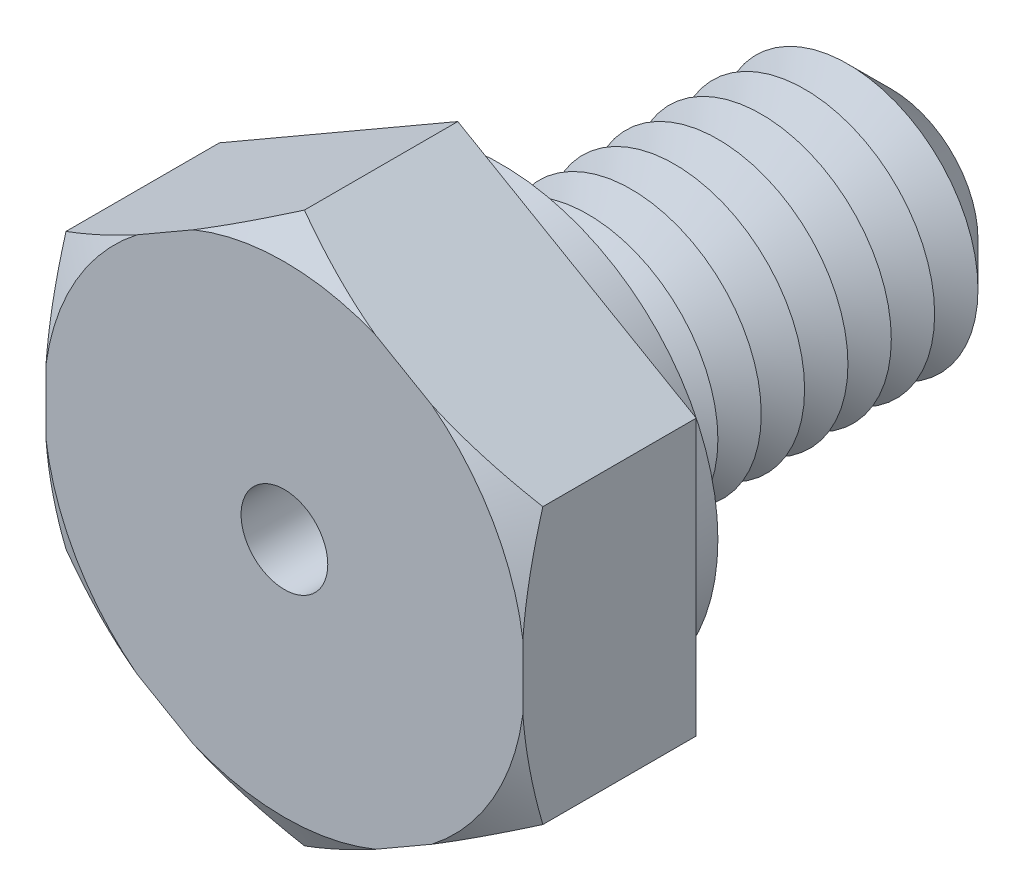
ISO-10303-21;
HEADER;
FILE_DESCRIPTION(('STEP AP214'),'2;1');
FILE_NAME('part.step','',(''),(''),'','','');
FILE_SCHEMA(('AUTOMOTIVE_DESIGN { 1 0 10303 214 1 1 1 1 }'));
ENDSEC;
DATA;
#1=APPLICATION_CONTEXT('core data for automotive mechanical design processes');
#2=APPLICATION_PROTOCOL_DEFINITION('international standard','automotive_design',2000,#1);
#3=PRODUCT_CONTEXT('',#1,'mechanical');
#4=PRODUCT('Part','Part','',(#3));
#5=PRODUCT_RELATED_PRODUCT_CATEGORY('part','',(#4));
#6=PRODUCT_DEFINITION_FORMATION('','',#4);
#7=PRODUCT_DEFINITION_CONTEXT('part definition',#1,'design');
#8=PRODUCT_DEFINITION('design','',#6,#7);
#9=PRODUCT_DEFINITION_SHAPE('','',#8);
#10=(LENGTH_UNIT() NAMED_UNIT(*) SI_UNIT(.MILLI.,.METRE.));
#11=(NAMED_UNIT(*) PLANE_ANGLE_UNIT() SI_UNIT($,.RADIAN.));
#12=(NAMED_UNIT(*) SI_UNIT($,.STERADIAN.) SOLID_ANGLE_UNIT());
#13=UNCERTAINTY_MEASURE_WITH_UNIT(LENGTH_MEASURE(1.E-05),#10,'distance_accuracy_value','');
#14=(GEOMETRIC_REPRESENTATION_CONTEXT(3) GLOBAL_UNCERTAINTY_ASSIGNED_CONTEXT((#13)) GLOBAL_UNIT_ASSIGNED_CONTEXT((#10,
#11,#12)) REPRESENTATION_CONTEXT('',''));
#15=CARTESIAN_POINT('',(0.,0.,0.));
#16=DIRECTION('',(0.,0.,1.));
#17=DIRECTION('',(1.,0.,0.));
#18=AXIS2_PLACEMENT_3D('',#15,#16,#17);
#19=CARTESIAN_POINT('',(2.75,1.58771324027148,2.));
#20=DIRECTION('',(-0.5,-0.866025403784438,0.));
#21=DIRECTION('',(0.866025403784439,-0.5,0.));
#22=AXIS2_PLACEMENT_3D('',#19,#20,#21);
#23=PLANE('',#22);
#24=CARTESIAN_POINT('',(4.66048793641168,0.484692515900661,0.897146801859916));
#25=CARTESIAN_POINT('',(4.57407924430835,0.534580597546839,0.943778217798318));
#26=CARTESIAN_POINT('',(4.48746398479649,0.584587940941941,0.989906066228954));
#27=CARTESIAN_POINT('',(4.31373297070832,0.684891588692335,1.08092005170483));
#28=CARTESIAN_POINT('',(4.22661715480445,0.735187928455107,1.12580603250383));
#29=CARTESIAN_POINT('',(4.05153903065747,0.836269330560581,1.21423144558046));
#30=CARTESIAN_POINT('',(3.96357490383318,0.887055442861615,1.25776609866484));
#31=CARTESIAN_POINT('',(3.78698874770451,0.989007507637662,1.34300583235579));
#32=CARTESIAN_POINT('',(3.69836673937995,1.04017344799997,1.38471097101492));
#33=CARTESIAN_POINT('',(3.42682968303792,1.196945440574,1.50858888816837));
#34=CARTESIAN_POINT('',(3.2426849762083,1.30326143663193,1.58723569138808));
#35=CARTESIAN_POINT('',(2.87039319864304,1.51820419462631,1.73037556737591));
#36=CARTESIAN_POINT('',(2.68225085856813,1.62682822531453,1.7948844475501));
#37=CARTESIAN_POINT('',(2.36072167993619,1.81246318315,1.88587189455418));
#38=CARTESIAN_POINT('',(2.22854222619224,1.88877702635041,1.91793719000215));
#39=CARTESIAN_POINT('',(1.9623222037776,2.04247922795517,1.96931401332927));
#40=CARTESIAN_POINT('',(1.82828230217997,2.11986720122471,1.98862999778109));
#41=CARTESIAN_POINT('',(1.56075616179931,2.27432349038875,2.0122791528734));
#42=CARTESIAN_POINT('',(1.42728171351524,2.35138499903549,2.01678452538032));
#43=CARTESIAN_POINT('',(1.16057863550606,2.50536609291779,2.01073620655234));
#44=CARTESIAN_POINT('',(1.02735002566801,2.58228566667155,2.00018134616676));
#45=CARTESIAN_POINT('',(0.804211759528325,2.71111460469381,1.97079823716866));
#46=CARTESIAN_POINT('',(0.7139172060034,2.76324618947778,1.95563842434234));
#47=CARTESIAN_POINT('',(0.534175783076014,2.86701994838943,1.91960186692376));
#48=CARTESIAN_POINT('',(0.444729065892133,2.91866203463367,1.89872411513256));
#49=CARTESIAN_POINT('',(0.266714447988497,3.02143882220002,1.85203328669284));
#50=CARTESIAN_POINT('',(0.178147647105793,3.07257288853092,1.82621469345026));
#51=CARTESIAN_POINT('',(0.002007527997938,3.17426743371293,1.77045729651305));
#52=CARTESIAN_POINT('',(-0.0855658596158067,3.22482795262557,1.74051878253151));
#53=CARTESIAN_POINT('',(-0.260818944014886,3.32601036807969,1.67685588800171));
#54=CARTESIAN_POINT('',(-0.348487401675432,3.37662577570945,1.64309053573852));
#55=CARTESIAN_POINT('',(-0.522893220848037,3.47731902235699,1.57271678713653));
#56=CARTESIAN_POINT('',(-0.609631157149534,3.52739719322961,1.53611027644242));
#57=CARTESIAN_POINT('',(-0.868655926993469,3.67694521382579,1.4228111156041));
#58=CARTESIAN_POINT('',(-1.03979736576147,3.775753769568,1.34262239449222));
#59=CARTESIAN_POINT('',(-1.26895816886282,3.90805982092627,1.23025748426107));
#60=CARTESIAN_POINT('',(-1.32802105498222,3.94215979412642,1.20084468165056));
#61=CARTESIAN_POINT('',(-1.44588766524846,4.01021011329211,1.14133764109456));
#62=CARTESIAN_POINT('',(-1.50469139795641,4.0441604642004,1.11124342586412));
#63=CARTESIAN_POINT('',(-1.67950896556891,4.14509143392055,1.02069737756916));
#64=CARTESIAN_POINT('',(-1.79518197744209,4.2118752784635,0.959363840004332));
#65=CARTESIAN_POINT('',(-1.91048793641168,4.27844720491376,0.897146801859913));
#66=B_SPLINE_CURVE_WITH_KNOTS('',3,(#24,#25,#26,#27,#28,#29,#30,#31,#32,#33,#34,#35,#36,#37,#38,
#39,#40,#41,#42,#43,#44,#45,#46,#47,#48,#49,#50,#51,#52,#53,#54,#55,#56,#57,#58,#59,#60,#61,#62,
#63,#64,#65),.UNSPECIFIED.,.F.,.F.,(4,2,2,2,2,2,2,2,2,2,2,2,2,2,2,2,2,2,2,2,4),(0.,
0.330408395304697,0.660858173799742,0.992367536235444,1.32386637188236,2.00369971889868,
2.68276903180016,3.15022294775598,3.61751337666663,4.0793510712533,4.54122461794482,
4.85714368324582,5.17311843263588,5.4894480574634,5.80575544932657,6.12584332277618,
6.44572054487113,7.08531613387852,7.30813289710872,7.5309422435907,7.97184194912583),.UNSPECIFIED.);
#67=CARTESIAN_POINT('',(2.75,1.58771324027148,1.76905989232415));
#68=VERTEX_POINT('',#67);
#69=CARTESIAN_POINT('',(1.69960608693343,2.1941584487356,2.));
#70=VERTEX_POINT('',#69);
#71=EDGE_CURVE('E132',#68,#70,#66,.T.);
#72=ORIENTED_EDGE('',*,*,#71,.F.);
#73=DIRECTION('',(0.,0.,-1.));
#74=VECTOR('',#73,1.);
#75=CARTESIAN_POINT('',(2.75,1.58771324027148,2.));
#76=LINE('',#75,#74);
#77=CARTESIAN_POINT('',(2.75,1.58771324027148,0.));
#78=VERTEX_POINT('',#77);
#79=EDGE_CURVE('E144',#68,#78,#76,.T.);
#80=ORIENTED_EDGE('',*,*,#79,.T.);
#81=DIRECTION('',(-0.866025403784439,0.5,0.));
#82=VECTOR('',#81,1.);
#83=CARTESIAN_POINT('',(2.75,1.58771324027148,0.));
#84=LINE('',#83,#82);
#85=CARTESIAN_POINT('',(0.,3.17542648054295,0.));
#86=VERTEX_POINT('',#85);
#87=EDGE_CURVE('E237',#78,#86,#84,.T.);
#88=ORIENTED_EDGE('',*,*,#87,.T.);
#89=DIRECTION('',(0.,0.,-1.));
#90=VECTOR('',#89,1.);
#91=CARTESIAN_POINT('',(0.,3.17542648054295,2.));
#92=LINE('',#91,#90);
#93=CARTESIAN_POINT('',(0.,3.17542648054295,1.76905989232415));
#94=VERTEX_POINT('',#93);
#95=EDGE_CURVE('E179',#94,#86,#92,.T.);
#96=ORIENTED_EDGE('',*,*,#95,.F.);
#97=CARTESIAN_POINT('',(1.05039391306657,2.56898127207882,2.));
#98=VERTEX_POINT('',#97);
#99=EDGE_CURVE('E151',#98,#94,#66,.T.);
#100=ORIENTED_EDGE('',*,*,#99,.F.);
#101=DIRECTION('',(-0.866025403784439,0.5,0.));
#102=VECTOR('',#101,1.);
#103=CARTESIAN_POINT('',(2.75,1.58771324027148,2.));
#104=LINE('',#103,#102);
#105=EDGE_CURVE('E148',#70,#98,#104,.T.);
#106=ORIENTED_EDGE('',*,*,#105,.F.);
#107=EDGE_LOOP('',(#72,#80,#88,#96,#100,#106));
#108=FACE_BOUND('',#107,.T.);
#109=ADVANCED_FACE('F39',(#108),#23,.F.);
#110=CARTESIAN_POINT('',(0.,3.17542648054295,2.));
#111=DIRECTION('',(0.5,-0.866025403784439,0.));
#112=DIRECTION('',(0.866025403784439,0.5,0.));
#113=AXIS2_PLACEMENT_3D('',#110,#111,#112);
#114=PLANE('',#113);
#115=CARTESIAN_POINT('',(1.91048793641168,4.27844720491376,0.897146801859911));
#116=CARTESIAN_POINT('',(1.82407924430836,4.22855912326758,0.943778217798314));
#117=CARTESIAN_POINT('',(1.7374639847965,4.17855177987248,0.98990606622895));
#118=CARTESIAN_POINT('',(1.56373297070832,4.07824813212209,1.08092005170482));
#119=CARTESIAN_POINT('',(1.47661715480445,4.02795179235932,1.12580603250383));
#120=CARTESIAN_POINT('',(1.30153903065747,3.92687039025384,1.21423144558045));
#121=CARTESIAN_POINT('',(1.21357490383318,3.87608427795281,1.25776609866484));
#122=CARTESIAN_POINT('',(1.03698874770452,3.77413221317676,1.34300583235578));
#123=CARTESIAN_POINT('',(0.948366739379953,3.72296627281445,1.38471097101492));
#124=CARTESIAN_POINT('',(0.676829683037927,3.56619428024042,1.50858888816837));
#125=CARTESIAN_POINT('',(0.492684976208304,3.45987828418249,1.58723569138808));
#126=CARTESIAN_POINT('',(0.120393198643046,3.24493552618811,1.73037556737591));
#127=CARTESIAN_POINT('',(-0.0677491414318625,3.13631149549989,1.7948844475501));
#128=CARTESIAN_POINT('',(-0.389278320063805,2.95067653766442,1.88587189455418));
#129=CARTESIAN_POINT('',(-0.521457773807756,2.87436269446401,1.91793719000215));
#130=CARTESIAN_POINT('',(-0.787677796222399,2.72066049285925,1.96931401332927));
#131=CARTESIAN_POINT('',(-0.921717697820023,2.64327251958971,1.98862999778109));
#132=CARTESIAN_POINT('',(-1.18924383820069,2.48881623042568,2.0122791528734));
#133=CARTESIAN_POINT('',(-1.32271828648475,2.41175472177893,2.01678452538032));
#134=CARTESIAN_POINT('',(-1.58942136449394,2.25777362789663,2.01073620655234));
#135=CARTESIAN_POINT('',(-1.72264997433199,2.18085405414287,2.00018134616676));
#136=CARTESIAN_POINT('',(-1.94578824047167,2.05202511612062,1.97079823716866));
#137=CARTESIAN_POINT('',(-2.0360827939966,1.99989353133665,1.95563842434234));
#138=CARTESIAN_POINT('',(-2.21582421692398,1.89611977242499,1.91960186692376));
#139=CARTESIAN_POINT('',(-2.30527093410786,1.84447768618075,1.89872411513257));
#140=CARTESIAN_POINT('',(-2.4832855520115,1.7417008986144,1.85203328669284));
#141=CARTESIAN_POINT('',(-2.5718523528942,1.69056683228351,1.82621469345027));
#142=CARTESIAN_POINT('',(-2.74799247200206,1.5888722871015,1.77045729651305));
#143=CARTESIAN_POINT('',(-2.8355658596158,1.53831176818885,1.74051878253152));
#144=CARTESIAN_POINT('',(-3.01081894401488,1.43712935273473,1.67685588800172));
#145=CARTESIAN_POINT('',(-3.09848740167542,1.38651394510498,1.64309053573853));
#146=CARTESIAN_POINT('',(-3.27289322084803,1.28582069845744,1.57271678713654));
#147=CARTESIAN_POINT('',(-3.35963115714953,1.23574252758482,1.53611027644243));
#148=CARTESIAN_POINT('',(-3.61865592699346,1.08619450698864,1.42281111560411));
#149=CARTESIAN_POINT('',(-3.78979736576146,0.987385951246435,1.34262239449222));
#150=CARTESIAN_POINT('',(-4.01895816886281,0.855079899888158,1.23025748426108));
#151=CARTESIAN_POINT('',(-4.07802105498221,0.820979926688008,1.20084468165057));
#152=CARTESIAN_POINT('',(-4.19588766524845,0.752929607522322,1.14133764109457));
#153=CARTESIAN_POINT('',(-4.25469139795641,0.71897925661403,1.11124342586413));
#154=CARTESIAN_POINT('',(-4.42950896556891,0.618048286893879,1.02069737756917));
#155=CARTESIAN_POINT('',(-4.54518197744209,0.551264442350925,0.959363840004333));
#156=CARTESIAN_POINT('',(-4.66048793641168,0.48469251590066,0.897146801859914));
#157=B_SPLINE_CURVE_WITH_KNOTS('',3,(#115,#116,#117,#118,#119,#120,#121,#122,#123,#124,#125,
#126,#127,#128,#129,#130,#131,#132,#133,#134,#135,#136,#137,#138,#139,#140,#141,#142,#143,#144,
#145,#146,#147,#148,#149,#150,#151,#152,#153,#154,#155,#156),.UNSPECIFIED.,.F.,.F.,(4,2,2,2,2,2,
2,2,2,2,2,2,2,2,2,2,2,2,2,2,4),(0.,0.330408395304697,0.660858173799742,0.992367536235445,
1.32386637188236,2.00369971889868,2.68276903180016,3.15022294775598,3.61751337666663,
4.0793510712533,4.54122461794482,4.85714368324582,5.17311843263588,5.48944805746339,
5.80575544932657,6.12584332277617,6.44572054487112,7.08531613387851,7.30813289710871,
7.53094224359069,7.97184194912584),.UNSPECIFIED.);
#158=CARTESIAN_POINT('',(-1.05039391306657,2.56898127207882,2.));
#159=VERTEX_POINT('',#158);
#160=EDGE_CURVE('E334',#94,#159,#157,.T.);
#161=ORIENTED_EDGE('',*,*,#160,.F.);
#162=ORIENTED_EDGE('',*,*,#95,.T.);
#163=DIRECTION('',(-0.866025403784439,-0.5,0.));
#164=VECTOR('',#163,1.);
#165=CARTESIAN_POINT('',(0.,3.17542648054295,0.));
#166=LINE('',#165,#164);
#167=CARTESIAN_POINT('',(-2.75,1.58771324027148,0.));
#168=VERTEX_POINT('',#167);
#169=EDGE_CURVE('E240',#86,#168,#166,.T.);
#170=ORIENTED_EDGE('',*,*,#169,.T.);
#171=DIRECTION('',(0.,0.,-1.));
#172=VECTOR('',#171,1.);
#173=CARTESIAN_POINT('',(-2.75,1.58771324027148,2.));
#174=LINE('',#173,#172);
#175=CARTESIAN_POINT('',(-2.75,1.58771324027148,1.76905989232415));
#176=VERTEX_POINT('',#175);
#177=EDGE_CURVE('E176',#176,#168,#174,.T.);
#178=ORIENTED_EDGE('',*,*,#177,.F.);
#179=CARTESIAN_POINT('',(-1.69960608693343,2.1941584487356,2.));
#180=VERTEX_POINT('',#179);
#181=EDGE_CURVE('E327',#180,#176,#157,.T.);
#182=ORIENTED_EDGE('',*,*,#181,.F.);
#183=DIRECTION('',(-0.866025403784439,-0.5,0.));
#184=VECTOR('',#183,1.);
#185=CARTESIAN_POINT('',(0.,3.17542648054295,2.));
#186=LINE('',#185,#184);
#187=EDGE_CURVE('E215',#159,#180,#186,.T.);
#188=ORIENTED_EDGE('',*,*,#187,.F.);
#189=EDGE_LOOP('',(#161,#162,#170,#178,#182,#188));
#190=FACE_BOUND('',#189,.T.);
#191=ADVANCED_FACE('F340',(#190),#114,.F.);
#192=CARTESIAN_POINT('',(-2.75,1.58771324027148,2.));
#193=DIRECTION('',(1.,0.,0.));
#194=DIRECTION('',(0.,0.,-1.));
#195=AXIS2_PLACEMENT_3D('',#192,#193,#194);
#196=PLANE('',#195);
#197=CARTESIAN_POINT('',(-2.75,3.49820117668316,1.03335245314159));
#198=CARTESIAN_POINT('',(-2.75,3.3988452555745,1.07843728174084));
#199=CARTESIAN_POINT('',(-2.75,3.29921780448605,1.12293477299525));
#200=CARTESIAN_POINT('',(-2.75,3.09930320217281,1.21047025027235));
#201=CARTESIAN_POINT('',(-2.75,2.9990159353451,1.25350797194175));
#202=CARTESIAN_POINT('',(-2.75,2.79728071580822,1.33799855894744));
#203=CARTESIAN_POINT('',(-2.75,2.69582966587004,1.37944406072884));
#204=CARTESIAN_POINT('',(-2.75,2.49207131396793,1.46016516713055));
#205=CARTESIAN_POINT('',(-2.75,2.38976405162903,1.49944087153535));
#206=CARTESIAN_POINT('',(-2.75,2.18462050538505,1.57517230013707));
#207=CARTESIAN_POINT('',(-2.75,2.0817886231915,1.61163983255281));
#208=CARTESIAN_POINT('',(-2.75,1.87503931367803,1.68134876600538));
#209=CARTESIAN_POINT('',(-2.75,1.7711218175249,1.71458996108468));
#210=CARTESIAN_POINT('',(-2.75,1.45784948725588,1.80833694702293));
#211=CARTESIAN_POINT('',(-2.75,1.24663799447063,1.86299520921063));
#212=CARTESIAN_POINT('',(-2.75,0.880007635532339,1.93741428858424));
#213=CARTESIAN_POINT('',(-2.75,0.725721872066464,1.96267397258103));
#214=CARTESIAN_POINT('',(-2.75,0.415477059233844,1.99905142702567));
#215=CARTESIAN_POINT('',(-2.75,0.259518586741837,2.01017392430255));
#216=CARTESIAN_POINT('',(-2.75,-0.052664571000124,2.01694102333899));
#217=CARTESIAN_POINT('',(-2.75,-0.208889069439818,2.01259389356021));
#218=CARTESIAN_POINT('',(-2.75,-0.52017905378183,1.98898893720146));
#219=CARTESIAN_POINT('',(-2.75,-0.675244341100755,1.96972861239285));
#220=CARTESIAN_POINT('',(-2.75,-1.06031237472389,1.90556109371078));
#221=CARTESIAN_POINT('',(-2.75,-1.28896433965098,1.85264132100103));
#222=CARTESIAN_POINT('',(-2.75,-1.62776674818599,1.75827794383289));
#223=CARTESIAN_POINT('',(-2.75,-1.7401527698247,1.72427052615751));
#224=CARTESIAN_POINT('',(-2.75,-1.96362143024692,1.65220283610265));
#225=CARTESIAN_POINT('',(-2.75,-2.07470418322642,1.61414292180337));
#226=CARTESIAN_POINT('',(-2.75,-2.29695720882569,1.53431422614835));
#227=CARTESIAN_POINT('',(-2.75,-2.40811380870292,1.49250783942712));
#228=CARTESIAN_POINT('',(-2.75,-2.6293886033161,1.40621968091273));
#229=CARTESIAN_POINT('',(-2.75,-2.73950673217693,1.36173774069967));
#230=CARTESIAN_POINT('',(-2.75,-2.95816234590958,1.27090723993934));
#231=CARTESIAN_POINT('',(-2.75,-3.06670540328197,1.22457202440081));
#232=CARTESIAN_POINT('',(-2.75,-3.2830047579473,1.130169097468));
#233=CARTESIAN_POINT('',(-2.75,-3.39076124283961,1.08210181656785));
#234=CARTESIAN_POINT('',(-2.75,-3.49820117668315,1.03335245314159));
#235=B_SPLINE_CURVE_WITH_KNOTS('',3,(#197,#198,#199,#200,#201,#202,#203,#204,#205,#206,#207,
#208,#209,#210,#211,#212,#213,#214,#215,#216,#217,#218,#219,#220,#221,#222,#223,#224,#225,#226,
#227,#228,#229,#230,#231,#232,#233,#234),.UNSPECIFIED.,.F.,.F.,(4,2,2,2,2,2,2,2,2,2,2,2,2,2,2,2,
2,2,4),(0.,0.327324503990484,0.654707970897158,0.983457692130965,1.31219228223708,
1.63945907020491,1.96674673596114,2.62024190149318,3.08872929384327,3.55706000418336,
4.02514043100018,4.49329928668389,5.19584793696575,5.54806763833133,5.9002562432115,
6.25649337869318,6.61275296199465,6.96679459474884,7.320748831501),.UNSPECIFIED.);
#236=CARTESIAN_POINT('',(-2.75,0.374822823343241,2.));
#237=VERTEX_POINT('',#236);
#238=EDGE_CURVE('E222',#176,#237,#235,.T.);
#239=ORIENTED_EDGE('',*,*,#238,.F.);
#240=ORIENTED_EDGE('',*,*,#177,.T.);
#241=DIRECTION('',(0.,-1.,0.));
#242=VECTOR('',#241,1.);
#243=CARTESIAN_POINT('',(-2.75,1.58771324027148,0.));
#244=LINE('',#243,#242);
#245=CARTESIAN_POINT('',(-2.75,-1.58771324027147,0.));
#246=VERTEX_POINT('',#245);
#247=EDGE_CURVE('E244',#168,#246,#244,.T.);
#248=ORIENTED_EDGE('',*,*,#247,.T.);
#249=DIRECTION('',(0.,0.,-1.));
#250=VECTOR('',#249,1.);
#251=CARTESIAN_POINT('',(-2.75,-1.58771324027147,2.));
#252=LINE('',#251,#250);
#253=CARTESIAN_POINT('',(-2.75000000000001,-1.58771324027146,1.76905989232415));
#254=VERTEX_POINT('',#253);
#255=EDGE_CURVE('E173',#254,#246,#252,.T.);
#256=ORIENTED_EDGE('',*,*,#255,.F.);
#257=CARTESIAN_POINT('',(-2.75,-0.374822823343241,2.));
#258=VERTEX_POINT('',#257);
#259=EDGE_CURVE('E225',#258,#254,#235,.T.);
#260=ORIENTED_EDGE('',*,*,#259,.F.);
#261=DIRECTION('',(0.,-1.,0.));
#262=VECTOR('',#261,1.);
#263=CARTESIAN_POINT('',(-2.75,1.58771324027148,2.));
#264=LINE('',#263,#262);
#265=EDGE_CURVE('E213',#237,#258,#264,.T.);
#266=ORIENTED_EDGE('',*,*,#265,.F.);
#267=EDGE_LOOP('',(#239,#240,#248,#256,#260,#266));
#268=FACE_BOUND('',#267,.T.);
#269=ADVANCED_FACE('F221',(#268),#196,.F.);
#270=CARTESIAN_POINT('',(-2.75,-1.58771324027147,2.));
#271=DIRECTION('',(0.5,0.866025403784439,0.));
#272=DIRECTION('',(-0.866025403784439,0.5,0.));
#273=AXIS2_PLACEMENT_3D('',#270,#271,#272);
#274=PLANE('',#273);
#275=CARTESIAN_POINT('',(-4.66048793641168,-0.48469251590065,0.897146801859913));
#276=CARTESIAN_POINT('',(-4.57407924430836,-0.534580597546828,0.943778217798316));
#277=CARTESIAN_POINT('',(-4.4874639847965,-0.58458794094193,0.989906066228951));
#278=CARTESIAN_POINT('',(-4.31373297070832,-0.684891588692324,1.08092005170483));
#279=CARTESIAN_POINT('',(-4.22661715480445,-0.735187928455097,1.12580603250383));
#280=CARTESIAN_POINT('',(-4.05153903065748,-0.83626933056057,1.21423144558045));
#281=CARTESIAN_POINT('',(-3.96357490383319,-0.887055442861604,1.25776609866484));
#282=CARTESIAN_POINT('',(-3.78698874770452,-0.989007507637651,1.34300583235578));
#283=CARTESIAN_POINT('',(-3.69836673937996,-1.04017344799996,1.38471097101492));
#284=CARTESIAN_POINT('',(-3.42682968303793,-1.19694544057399,1.50858888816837));
#285=CARTESIAN_POINT('',(-3.24268497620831,-1.30326143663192,1.58723569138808));
#286=CARTESIAN_POINT('',(-2.87039319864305,-1.5182041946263,1.73037556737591));
#287=CARTESIAN_POINT('',(-2.68225085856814,-1.62682822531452,1.7948844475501));
#288=CARTESIAN_POINT('',(-2.3607216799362,-1.81246318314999,1.88587189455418));
#289=CARTESIAN_POINT('',(-2.22854222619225,-1.8887770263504,1.91793719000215));
#290=CARTESIAN_POINT('',(-1.96232220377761,-2.04247922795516,1.96931401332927));
#291=CARTESIAN_POINT('',(-1.82828230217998,-2.1198672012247,1.98862999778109));
#292=CARTESIAN_POINT('',(-1.56075616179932,-2.27432349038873,2.0122791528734));
#293=CARTESIAN_POINT('',(-1.42728171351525,-2.35138499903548,2.01678452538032));
#294=CARTESIAN_POINT('',(-1.16057863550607,-2.50536609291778,2.01073620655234));
#295=CARTESIAN_POINT('',(-1.02735002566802,-2.58228566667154,2.00018134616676));
#296=CARTESIAN_POINT('',(-0.804211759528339,-2.71111460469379,1.97079823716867));
#297=CARTESIAN_POINT('',(-0.713917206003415,-2.76324618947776,1.95563842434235));
#298=CARTESIAN_POINT('',(-0.534175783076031,-2.86701994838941,1.91960186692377));
#299=CARTESIAN_POINT('',(-0.444729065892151,-2.91866203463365,1.89872411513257));
#300=CARTESIAN_POINT('',(-0.266714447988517,-3.02143882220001,1.85203328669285));
#301=CARTESIAN_POINT('',(-0.178147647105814,-3.0725728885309,1.82621469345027));
#302=CARTESIAN_POINT('',(-0.00200752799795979,-3.17426743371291,1.77045729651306));
#303=CARTESIAN_POINT('',(0.085565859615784,-3.22482795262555,1.74051878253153));
#304=CARTESIAN_POINT('',(0.260818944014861,-3.32601036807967,1.67685588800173));
#305=CARTESIAN_POINT('',(0.348487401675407,-3.37662577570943,1.64309053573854));
#306=CARTESIAN_POINT('',(0.522893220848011,-3.47731902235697,1.57271678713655));
#307=CARTESIAN_POINT('',(0.609631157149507,-3.52739719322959,1.53611027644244));
#308=CARTESIAN_POINT('',(0.86865592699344,-3.67694521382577,1.42281111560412));
#309=CARTESIAN_POINT('',(1.03979736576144,-3.77575376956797,1.34262239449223));
#310=CARTESIAN_POINT('',(1.26895816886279,-3.90805982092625,1.23025748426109));
#311=CARTESIAN_POINT('',(1.32802105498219,-3.9421597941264,1.20084468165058));
#312=CARTESIAN_POINT('',(1.44588766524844,-4.01021011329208,1.14133764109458));
#313=CARTESIAN_POINT('',(1.5046913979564,-4.04416046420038,1.11124342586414));
#314=CARTESIAN_POINT('',(1.6795089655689,-4.14509143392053,1.02069737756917));
#315=CARTESIAN_POINT('',(1.79518197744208,-4.21187527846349,0.959363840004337));
#316=CARTESIAN_POINT('',(1.91048793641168,-4.27844720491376,0.897146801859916));
#317=B_SPLINE_CURVE_WITH_KNOTS('',3,(#275,#276,#277,#278,#279,#280,#281,#282,#283,#284,#285,
#286,#287,#288,#289,#290,#291,#292,#293,#294,#295,#296,#297,#298,#299,#300,#301,#302,#303,#304,
#305,#306,#307,#308,#309,#310,#311,#312,#313,#314,#315,#316),.UNSPECIFIED.,.F.,.F.,(4,2,2,2,2,2,
2,2,2,2,2,2,2,2,2,2,2,2,2,2,4),(0.,0.330408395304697,0.660858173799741,0.992367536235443,
1.32386637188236,2.00369971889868,2.68276903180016,3.15022294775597,3.61751337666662,
4.0793510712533,4.54122461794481,4.85714368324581,5.17311843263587,5.48944805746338,
5.80575544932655,6.12584332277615,6.44572054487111,7.08531613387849,7.3081328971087,
7.53094224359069,7.97184194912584),.UNSPECIFIED.);
#318=CARTESIAN_POINT('',(-1.69960608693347,-2.19415844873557,2.));
#319=VERTEX_POINT('',#318);
#320=EDGE_CURVE('E376',#254,#319,#317,.T.);
#321=ORIENTED_EDGE('',*,*,#320,.F.);
#322=ORIENTED_EDGE('',*,*,#255,.T.);
#323=DIRECTION('',(0.866025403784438,-0.5,0.));
#324=VECTOR('',#323,1.);
#325=CARTESIAN_POINT('',(-2.75,-1.58771324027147,0.));
#326=LINE('',#325,#324);
#327=CARTESIAN_POINT('',(0.,-3.17542648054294,0.));
#328=VERTEX_POINT('',#327);
#329=EDGE_CURVE('E248',#246,#328,#326,.T.);
#330=ORIENTED_EDGE('',*,*,#329,.T.);
#331=DIRECTION('',(0.,0.,-1.));
#332=VECTOR('',#331,1.);
#333=CARTESIAN_POINT('',(0.,-3.17542648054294,2.));
#334=LINE('',#333,#332);
#335=CARTESIAN_POINT('',(0.,-3.17542648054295,1.76905989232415));
#336=VERTEX_POINT('',#335);
#337=EDGE_CURVE('E163',#336,#328,#334,.T.);
#338=ORIENTED_EDGE('',*,*,#337,.F.);
#339=CARTESIAN_POINT('',(-1.05039391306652,-2.56898127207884,2.));
#340=VERTEX_POINT('',#339);
#341=EDGE_CURVE('E371',#340,#336,#317,.T.);
#342=ORIENTED_EDGE('',*,*,#341,.F.);
#343=DIRECTION('',(0.866025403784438,-0.5,0.));
#344=VECTOR('',#343,1.);
#345=CARTESIAN_POINT('',(-2.75,-1.58771324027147,2.));
#346=LINE('',#345,#344);
#347=EDGE_CURVE('E227',#319,#340,#346,.T.);
#348=ORIENTED_EDGE('',*,*,#347,.F.);
#349=EDGE_LOOP('',(#321,#322,#330,#338,#342,#348));
#350=FACE_BOUND('',#349,.T.);
#351=ADVANCED_FACE('F377',(#350),#274,.F.);
#352=CARTESIAN_POINT('',(0.,-3.17542648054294,2.));
#353=DIRECTION('',(-0.5,0.866025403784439,0.));
#354=DIRECTION('',(-0.866025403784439,-0.5,0.));
#355=AXIS2_PLACEMENT_3D('',#352,#353,#354);
#356=PLANE('',#355);
#357=CARTESIAN_POINT('',(-1.91048793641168,-4.27844720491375,0.897146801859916));
#358=CARTESIAN_POINT('',(-1.82407924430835,-4.22855912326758,0.943778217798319));
#359=CARTESIAN_POINT('',(-1.73746398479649,-4.17855177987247,0.989906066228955));
#360=CARTESIAN_POINT('',(-1.56373297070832,-4.07824813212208,1.08092005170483));
#361=CARTESIAN_POINT('',(-1.47661715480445,-4.02795179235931,1.12580603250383));
#362=CARTESIAN_POINT('',(-1.30153903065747,-3.92687039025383,1.21423144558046));
#363=CARTESIAN_POINT('',(-1.21357490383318,-3.8760842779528,1.25776609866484));
#364=CARTESIAN_POINT('',(-1.03698874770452,-3.77413221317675,1.34300583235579));
#365=CARTESIAN_POINT('',(-0.948366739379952,-3.72296627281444,1.38471097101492));
#366=CARTESIAN_POINT('',(-0.676829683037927,-3.56619428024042,1.50858888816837));
#367=CARTESIAN_POINT('',(-0.492684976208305,-3.45987828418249,1.58723569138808));
#368=CARTESIAN_POINT('',(-0.120393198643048,-3.2449355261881,1.73037556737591));
#369=CARTESIAN_POINT('',(0.0677491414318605,-3.13631149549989,1.7948844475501));
#370=CARTESIAN_POINT('',(0.389278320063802,-2.95067653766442,1.88587189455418));
#371=CARTESIAN_POINT('',(0.521457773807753,-2.87436269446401,1.91793719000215));
#372=CARTESIAN_POINT('',(0.787677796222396,-2.72066049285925,1.96931401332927));
#373=CARTESIAN_POINT('',(0.921717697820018,-2.64327251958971,1.9886299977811));
#374=CARTESIAN_POINT('',(1.18924383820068,-2.48881623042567,2.0122791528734));
#375=CARTESIAN_POINT('',(1.32271828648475,-2.41175472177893,2.01678452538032));
#376=CARTESIAN_POINT('',(1.58942136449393,-2.25777362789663,2.01073620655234));
#377=CARTESIAN_POINT('',(1.72264997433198,-2.18085405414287,2.00018134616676));
#378=CARTESIAN_POINT('',(1.94578824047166,-2.05202511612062,1.97079823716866));
#379=CARTESIAN_POINT('',(2.03608279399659,-1.99989353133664,1.95563842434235));
#380=CARTESIAN_POINT('',(2.21582421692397,-1.89611977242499,1.91960186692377));
#381=CARTESIAN_POINT('',(2.30527093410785,-1.84447768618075,1.89872411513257));
#382=CARTESIAN_POINT('',(2.48328555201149,-1.7417008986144,1.85203328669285));
#383=CARTESIAN_POINT('',(2.57185235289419,-1.69056683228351,1.82621469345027));
#384=CARTESIAN_POINT('',(2.74799247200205,-1.58887228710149,1.77045729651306));
#385=CARTESIAN_POINT('',(2.83556585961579,-1.53831176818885,1.74051878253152));
#386=CARTESIAN_POINT('',(3.01081894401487,-1.43712935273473,1.67685588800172));
#387=CARTESIAN_POINT('',(3.09848740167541,-1.38651394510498,1.64309053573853));
#388=CARTESIAN_POINT('',(3.27289322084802,-1.28582069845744,1.57271678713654));
#389=CARTESIAN_POINT('',(3.35963115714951,-1.23574252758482,1.53611027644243));
#390=CARTESIAN_POINT('',(3.61865592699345,-1.08619450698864,1.42281111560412));
#391=CARTESIAN_POINT('',(3.78979736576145,-0.987385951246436,1.34262239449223));
#392=CARTESIAN_POINT('',(4.0189581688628,-0.855079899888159,1.23025748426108));
#393=CARTESIAN_POINT('',(4.0780210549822,-0.820979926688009,1.20084468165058));
#394=CARTESIAN_POINT('',(4.19588766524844,-0.752929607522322,1.14133764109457));
#395=CARTESIAN_POINT('',(4.2546913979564,-0.718979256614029,1.11124342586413));
#396=CARTESIAN_POINT('',(4.4295089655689,-0.618048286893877,1.02069737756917));
#397=CARTESIAN_POINT('',(4.54518197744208,-0.551264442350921,0.959363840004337));
#398=CARTESIAN_POINT('',(4.66048793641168,-0.484692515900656,0.897146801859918));
#399=B_SPLINE_CURVE_WITH_KNOTS('',3,(#357,#358,#359,#360,#361,#362,#363,#364,#365,#366,#367,
#368,#369,#370,#371,#372,#373,#374,#375,#376,#377,#378,#379,#380,#381,#382,#383,#384,#385,#386,
#387,#388,#389,#390,#391,#392,#393,#394,#395,#396,#397,#398),.UNSPECIFIED.,.F.,.F.,(4,2,2,2,2,2,
2,2,2,2,2,2,2,2,2,2,2,2,2,2,4),(0.,0.330408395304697,0.660858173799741,0.992367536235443,
1.32386637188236,2.00369971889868,2.68276903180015,3.15022294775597,3.61751337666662,
4.07935107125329,4.54122461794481,4.85714368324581,5.17311843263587,5.48944805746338,
5.80575544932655,6.12584332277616,6.44572054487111,7.08531613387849,7.3081328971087,
7.53094224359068,7.97184194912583),.UNSPECIFIED.);
#400=CARTESIAN_POINT('',(1.05039391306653,-2.56898127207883,2.));
#401=VERTEX_POINT('',#400);
#402=EDGE_CURVE('E64',#336,#401,#399,.T.);
#403=ORIENTED_EDGE('',*,*,#402,.F.);
#404=ORIENTED_EDGE('',*,*,#337,.T.);
#405=DIRECTION('',(0.866025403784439,0.5,0.));
#406=VECTOR('',#405,1.);
#407=CARTESIAN_POINT('',(0.,-3.17542648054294,0.));
#408=LINE('',#407,#406);
#409=CARTESIAN_POINT('',(2.75,-1.58771324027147,0.));
#410=VERTEX_POINT('',#409);
#411=EDGE_CURVE('E251',#328,#410,#408,.T.);
#412=ORIENTED_EDGE('',*,*,#411,.T.);
#413=DIRECTION('',(0.,0.,-1.));
#414=VECTOR('',#413,1.);
#415=CARTESIAN_POINT('',(2.75,-1.58771324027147,2.));
#416=LINE('',#415,#414);
#417=CARTESIAN_POINT('',(2.75,-1.58771324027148,1.76905989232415));
#418=VERTEX_POINT('',#417);
#419=EDGE_CURVE('E157',#418,#410,#416,.T.);
#420=ORIENTED_EDGE('',*,*,#419,.F.);
#421=CARTESIAN_POINT('',(1.69960608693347,-2.19415844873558,2.));
#422=VERTEX_POINT('',#421);
#423=EDGE_CURVE('E366',#422,#418,#399,.T.);
#424=ORIENTED_EDGE('',*,*,#423,.F.);
#425=DIRECTION('',(0.866025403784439,0.5,0.));
#426=VECTOR('',#425,1.);
#427=CARTESIAN_POINT('',(0.,-3.17542648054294,2.));
#428=LINE('',#427,#426);
#429=EDGE_CURVE('E166',#401,#422,#428,.T.);
#430=ORIENTED_EDGE('',*,*,#429,.F.);
#431=EDGE_LOOP('',(#403,#404,#412,#420,#424,#430));
#432=FACE_BOUND('',#431,.T.);
#433=ADVANCED_FACE('F380',(#432),#356,.F.);
#434=CARTESIAN_POINT('',(2.75,-1.58771324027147,2.));
#435=DIRECTION('',(-1.,0.,0.));
#436=DIRECTION('',(0.,-1.,0.));
#437=AXIS2_PLACEMENT_3D('',#434,#435,#436);
#438=PLANE('',#437);
#439=CARTESIAN_POINT('',(2.75,-3.49820117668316,1.03335245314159));
#440=CARTESIAN_POINT('',(2.75,-3.3988452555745,1.07843728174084));
#441=CARTESIAN_POINT('',(2.75,-3.29921780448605,1.12293477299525));
#442=CARTESIAN_POINT('',(2.75,-3.0993032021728,1.21047025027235));
#443=CARTESIAN_POINT('',(2.75,-2.99901593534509,1.25350797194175));
#444=CARTESIAN_POINT('',(2.75,-2.79728071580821,1.33799855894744));
#445=CARTESIAN_POINT('',(2.75,-2.69582966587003,1.37944406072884));
#446=CARTESIAN_POINT('',(2.75,-2.49207131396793,1.46016516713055));
#447=CARTESIAN_POINT('',(2.75,-2.38976405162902,1.49944087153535));
#448=CARTESIAN_POINT('',(2.75,-2.18462050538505,1.57517230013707));
#449=CARTESIAN_POINT('',(2.75,-2.0817886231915,1.61163983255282));
#450=CARTESIAN_POINT('',(2.75,-1.87503931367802,1.68134876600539));
#451=CARTESIAN_POINT('',(2.75,-1.7711218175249,1.71458996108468));
#452=CARTESIAN_POINT('',(2.75,-1.45784948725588,1.80833694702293));
#453=CARTESIAN_POINT('',(2.75,-1.24663799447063,1.86299520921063));
#454=CARTESIAN_POINT('',(2.75,-0.880007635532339,1.93741428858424));
#455=CARTESIAN_POINT('',(2.75,-0.725721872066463,1.96267397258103));
#456=CARTESIAN_POINT('',(2.75,-0.415477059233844,1.99905142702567));
#457=CARTESIAN_POINT('',(2.75,-0.259518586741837,2.01017392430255));
#458=CARTESIAN_POINT('',(2.75,0.0526645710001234,2.01694102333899));
#459=CARTESIAN_POINT('',(2.75,0.208889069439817,2.01259389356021));
#460=CARTESIAN_POINT('',(2.75,0.52017905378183,1.98898893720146));
#461=CARTESIAN_POINT('',(2.75,0.675244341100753,1.96972861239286));
#462=CARTESIAN_POINT('',(2.75,1.06031237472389,1.90556109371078));
#463=CARTESIAN_POINT('',(2.75,1.28896433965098,1.85264132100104));
#464=CARTESIAN_POINT('',(2.75,1.62776674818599,1.75827794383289));
#465=CARTESIAN_POINT('',(2.75,1.74015276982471,1.72427052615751));
#466=CARTESIAN_POINT('',(2.75,1.96362143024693,1.65220283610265));
#467=CARTESIAN_POINT('',(2.75,2.07470418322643,1.61414292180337));
#468=CARTESIAN_POINT('',(2.75,2.2969572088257,1.53431422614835));
#469=CARTESIAN_POINT('',(2.75,2.40811380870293,1.49250783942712));
#470=CARTESIAN_POINT('',(2.75,2.62938860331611,1.40621968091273));
#471=CARTESIAN_POINT('',(2.75,2.73950673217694,1.36173774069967));
#472=CARTESIAN_POINT('',(2.75,2.95816234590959,1.27090723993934));
#473=CARTESIAN_POINT('',(2.75,3.06670540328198,1.22457202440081));
#474=CARTESIAN_POINT('',(2.75,3.28300475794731,1.13016909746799));
#475=CARTESIAN_POINT('',(2.75,3.39076124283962,1.08210181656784));
#476=CARTESIAN_POINT('',(2.75,3.49820117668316,1.03335245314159));
#477=B_SPLINE_CURVE_WITH_KNOTS('',3,(#439,#440,#441,#442,#443,#444,#445,#446,#447,#448,#449,
#450,#451,#452,#453,#454,#455,#456,#457,#458,#459,#460,#461,#462,#463,#464,#465,#466,#467,#468,
#469,#470,#471,#472,#473,#474,#475,#476),.UNSPECIFIED.,.F.,.F.,(4,2,2,2,2,2,2,2,2,2,2,2,2,2,2,2,
2,2,4),(0.,0.327324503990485,0.654707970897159,0.983457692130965,1.31219228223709,
1.63945907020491,1.96674673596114,2.62024190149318,3.08872929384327,3.55706000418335,
4.02514043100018,4.49329928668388,5.19584793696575,5.54806763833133,5.9002562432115,
6.25649337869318,6.61275296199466,6.96679459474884,7.320748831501),.UNSPECIFIED.);
#478=CARTESIAN_POINT('',(2.75,-0.374822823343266,2.));
#479=VERTEX_POINT('',#478);
#480=EDGE_CURVE('E56',#418,#479,#477,.T.);
#481=ORIENTED_EDGE('',*,*,#480,.F.);
#482=ORIENTED_EDGE('',*,*,#419,.T.);
#483=DIRECTION('',(0.,1.,0.));
#484=VECTOR('',#483,1.);
#485=CARTESIAN_POINT('',(2.75,-1.58771324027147,0.));
#486=LINE('',#485,#484);
#487=EDGE_CURVE('E154',#410,#78,#486,.T.);
#488=ORIENTED_EDGE('',*,*,#487,.T.);
#489=ORIENTED_EDGE('',*,*,#79,.F.);
#490=CARTESIAN_POINT('',(2.75,0.374822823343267,2.));
#491=VERTEX_POINT('',#490);
#492=EDGE_CURVE('E129',#491,#68,#477,.T.);
#493=ORIENTED_EDGE('',*,*,#492,.F.);
#494=DIRECTION('',(0.,1.,0.));
#495=VECTOR('',#494,1.);
#496=CARTESIAN_POINT('',(2.75,-1.58771324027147,2.));
#497=LINE('',#496,#495);
#498=EDGE_CURVE('E158',#479,#491,#497,.T.);
#499=ORIENTED_EDGE('',*,*,#498,.F.);
#500=EDGE_LOOP('',(#481,#482,#488,#489,#493,#499));
#501=FACE_BOUND('',#500,.T.);
#502=ADVANCED_FACE('F152',(#501),#438,.F.);
#503=CARTESIAN_POINT('',(0.,0.,2.));
#504=DIRECTION('',(0.,0.,1.));
#505=DIRECTION('',(1.,0.,0.));
#506=AXIS2_PLACEMENT_3D('',#503,#504,#505);
#507=PLANE('',#506);
#508=CARTESIAN_POINT('',(0.,0.,2.));
#509=DIRECTION('',(0.,0.,1.));
#510=DIRECTION('',(1.,0.,0.));
#511=AXIS2_PLACEMENT_3D('',#508,#509,#510);
#512=CIRCLE('',#511,0.5);
#513=CARTESIAN_POINT('',(0.5,0.,2.));
#514=VERTEX_POINT('',#513);
#515=EDGE_CURVE('E732',#514,#514,#512,.T.);
#516=ORIENTED_EDGE('',*,*,#515,.F.);
#517=EDGE_LOOP('',(#516));
#518=FACE_BOUND('',#517,.T.);
#519=ORIENTED_EDGE('',*,*,#498,.T.);
#520=CARTESIAN_POINT('',(0.,0.,2.));
#521=DIRECTION('',(0.,0.,1.));
#522=DIRECTION('',(1.,0.,0.));
#523=AXIS2_PLACEMENT_3D('',#520,#521,#522);
#524=CIRCLE('',#523,2.77542648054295);
#525=EDGE_CURVE('E134',#491,#70,#524,.T.);
#526=ORIENTED_EDGE('',*,*,#525,.T.);
#527=ORIENTED_EDGE('',*,*,#105,.T.);
#528=CARTESIAN_POINT('',(0.,0.,2.));
#529=DIRECTION('',(0.,0.,1.));
#530=DIRECTION('',(1.,0.,0.));
#531=AXIS2_PLACEMENT_3D('',#528,#529,#530);
#532=CIRCLE('',#531,2.77542648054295);
#533=EDGE_CURVE('E11',#98,#159,#532,.T.);
#534=ORIENTED_EDGE('',*,*,#533,.T.);
#535=ORIENTED_EDGE('',*,*,#187,.T.);
#536=EDGE_CURVE('E49',#180,#237,#532,.T.);
#537=ORIENTED_EDGE('',*,*,#536,.T.);
#538=ORIENTED_EDGE('',*,*,#265,.T.);
#539=EDGE_CURVE('E199',#258,#319,#532,.T.);
#540=ORIENTED_EDGE('',*,*,#539,.T.);
#541=ORIENTED_EDGE('',*,*,#347,.T.);
#542=EDGE_CURVE('E193',#340,#401,#532,.T.);
#543=ORIENTED_EDGE('',*,*,#542,.T.);
#544=ORIENTED_EDGE('',*,*,#429,.T.);
#545=EDGE_CURVE('E43',#422,#479,#532,.T.);
#546=ORIENTED_EDGE('',*,*,#545,.T.);
#547=EDGE_LOOP('',(#519,#526,#527,#534,#535,#537,#538,#540,#541,#543,#544,#546));
#548=FACE_BOUND('',#547,.T.);
#549=ADVANCED_FACE('F212',(#518,#548),#507,.T.);
#550=CARTESIAN_POINT('',(0.,0.,0.));
#551=DIRECTION('',(0.,0.,1.));
#552=DIRECTION('',(1.,0.,0.));
#553=AXIS2_PLACEMENT_3D('',#550,#551,#552);
#554=PLANE('',#553);
#555=CARTESIAN_POINT('',(0.,0.,0.));
#556=DIRECTION('',(0.,0.,1.));
#557=DIRECTION('',(1.,0.,0.));
#558=AXIS2_PLACEMENT_3D('',#555,#556,#557);
#559=CIRCLE('',#558,2.5);
#560=CARTESIAN_POINT('',(2.5,0.,0.));
#561=VERTEX_POINT('',#560);
#562=EDGE_CURVE('E182',#561,#561,#559,.F.);
#563=ORIENTED_EDGE('',*,*,#562,.F.);
#564=EDGE_LOOP('',(#563));
#565=FACE_BOUND('',#564,.T.);
#566=ORIENTED_EDGE('',*,*,#87,.F.);
#567=ORIENTED_EDGE('',*,*,#487,.F.);
#568=ORIENTED_EDGE('',*,*,#411,.F.);
#569=ORIENTED_EDGE('',*,*,#329,.F.);
#570=ORIENTED_EDGE('',*,*,#247,.F.);
#571=ORIENTED_EDGE('',*,*,#169,.F.);
#572=EDGE_LOOP('',(#566,#567,#568,#569,#570,#571));
#573=FACE_BOUND('',#572,.T.);
#574=ADVANCED_FACE('F424',(#565,#573),#554,.F.);
#575=CARTESIAN_POINT('',(0.,0.,-0.5));
#576=DIRECTION('',(0.,0.,1.));
#577=DIRECTION('',(1.,0.,0.));
#578=AXIS2_PLACEMENT_3D('',#575,#576,#577);
#579=CYLINDRICAL_SURFACE('',#578,2.5);
#580=CARTESIAN_POINT('',(0.,0.,-0.5));
#581=DIRECTION('',(0.,0.,-1.));
#582=DIRECTION('',(-1.,0.,0.));
#583=AXIS2_PLACEMENT_3D('',#580,#581,#582);
#584=CIRCLE('',#583,2.5);
#585=CARTESIAN_POINT('',(-2.5,0.,-0.5));
#586=VERTEX_POINT('',#585);
#587=EDGE_CURVE('E241',#586,#586,#584,.T.);
#588=ORIENTED_EDGE('',*,*,#587,.F.);
#589=EDGE_LOOP('',(#588));
#590=FACE_BOUND('',#589,.T.);
#591=ORIENTED_EDGE('',*,*,#562,.T.);
#592=EDGE_LOOP('',(#591));
#593=FACE_BOUND('',#592,.T.);
#594=ADVANCED_FACE('F435',(#590,#593),#579,.T.);
#595=CARTESIAN_POINT('',(0.,0.,-0.5));
#596=DIRECTION('',(0.,0.,-1.));
#597=DIRECTION('',(-1.,0.,0.));
#598=AXIS2_PLACEMENT_3D('',#595,#596,#597);
#599=PLANE('',#598);
#600=CARTESIAN_POINT('',(0.,0.,-0.5));
#601=DIRECTION('',(0.,0.,1.));
#602=DIRECTION('',(1.,0.,0.));
#603=AXIS2_PLACEMENT_3D('',#600,#601,#602);
#604=CIRCLE('',#603,1.5);
#605=CARTESIAN_POINT('',(1.5,0.,-0.5));
#606=VERTEX_POINT('',#605);
#607=EDGE_CURVE('E265',#606,#606,#604,.T.);
#608=ORIENTED_EDGE('',*,*,#607,.T.);
#609=EDGE_LOOP('',(#608));
#610=FACE_BOUND('',#609,.T.);
#611=ORIENTED_EDGE('',*,*,#587,.T.);
#612=EDGE_LOOP('',(#611));
#613=FACE_BOUND('',#612,.T.);
#614=ADVANCED_FACE('F444',(#610,#613),#599,.T.);
#615=CARTESIAN_POINT('',(0.,0.,-0.5));
#616=DIRECTION('',(0.,0.,1.));
#617=DIRECTION('',(1.,0.,0.));
#618=AXIS2_PLACEMENT_3D('',#615,#616,#617);
#619=CONICAL_SURFACE('',#618,1.5,1.0471975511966);
#620=CARTESIAN_POINT('',(0.,0.,-0.75));
#621=DIRECTION('',(0.,0.,1.));
#622=DIRECTION('',(1.,0.,0.));
#623=AXIS2_PLACEMENT_3D('',#620,#621,#622);
#624=CIRCLE('',#623,1.06698729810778);
#625=CARTESIAN_POINT('',(1.06698729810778,0.,-0.75));
#626=VERTEX_POINT('',#625);
#627=EDGE_CURVE('E269',#626,#626,#624,.T.);
#628=ORIENTED_EDGE('',*,*,#627,.T.);
#629=EDGE_LOOP('',(#628));
#630=FACE_BOUND('',#629,.T.);
#631=ORIENTED_EDGE('',*,*,#607,.F.);
#632=EDGE_LOOP('',(#631));
#633=FACE_BOUND('',#632,.T.);
#634=ADVANCED_FACE('F453',(#630,#633),#619,.T.);
#635=CARTESIAN_POINT('',(0.,0.,-0.75));
#636=DIRECTION('',(0.,0.,-1.));
#637=DIRECTION('',(-1.,0.,0.));
#638=AXIS2_PLACEMENT_3D('',#635,#636,#637);
#639=CONICAL_SURFACE('',#638,1.06698729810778,1.0471975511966);
#640=CARTESIAN_POINT('',(0.,0.,-1.));
#641=DIRECTION('',(0.,0.,1.));
#642=DIRECTION('',(1.,0.,0.));
#643=AXIS2_PLACEMENT_3D('',#640,#641,#642);
#644=CIRCLE('',#643,1.5);
#645=CARTESIAN_POINT('',(1.5,0.,-1.));
#646=VERTEX_POINT('',#645);
#647=EDGE_CURVE('E273',#646,#646,#644,.T.);
#648=ORIENTED_EDGE('',*,*,#647,.T.);
#649=EDGE_LOOP('',(#648));
#650=FACE_BOUND('',#649,.T.);
#651=ORIENTED_EDGE('',*,*,#627,.F.);
#652=EDGE_LOOP('',(#651));
#653=FACE_BOUND('',#652,.T.);
#654=ADVANCED_FACE('F463',(#650,#653),#639,.T.);
#655=CARTESIAN_POINT('',(0.,0.,-1.));
#656=DIRECTION('',(0.,0.,1.));
#657=DIRECTION('',(1.,0.,0.));
#658=AXIS2_PLACEMENT_3D('',#655,#656,#657);
#659=CONICAL_SURFACE('',#658,1.5,1.0471975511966);
#660=CARTESIAN_POINT('',(0.,0.,-1.25));
#661=DIRECTION('',(0.,0.,1.));
#662=DIRECTION('',(1.,0.,0.));
#663=AXIS2_PLACEMENT_3D('',#660,#661,#662);
#664=CIRCLE('',#663,1.06698729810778);
#665=CARTESIAN_POINT('',(1.06698729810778,0.,-1.25));
#666=VERTEX_POINT('',#665);
#667=EDGE_CURVE('E276',#666,#666,#664,.T.);
#668=ORIENTED_EDGE('',*,*,#667,.T.);
#669=EDGE_LOOP('',(#668));
#670=FACE_BOUND('',#669,.T.);
#671=ORIENTED_EDGE('',*,*,#647,.F.);
#672=EDGE_LOOP('',(#671));
#673=FACE_BOUND('',#672,.T.);
#674=ADVANCED_FACE('F472',(#670,#673),#659,.T.);
#675=CARTESIAN_POINT('',(0.,0.,-1.25));
#676=DIRECTION('',(0.,0.,-1.));
#677=DIRECTION('',(-1.,0.,0.));
#678=AXIS2_PLACEMENT_3D('',#675,#676,#677);
#679=CONICAL_SURFACE('',#678,1.06698729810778,1.0471975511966);
#680=CARTESIAN_POINT('',(0.,0.,-1.5));
#681=DIRECTION('',(0.,0.,1.));
#682=DIRECTION('',(1.,0.,0.));
#683=AXIS2_PLACEMENT_3D('',#680,#681,#682);
#684=CIRCLE('',#683,1.5);
#685=CARTESIAN_POINT('',(1.5,0.,-1.5));
#686=VERTEX_POINT('',#685);
#687=EDGE_CURVE('E280',#686,#686,#684,.T.);
#688=ORIENTED_EDGE('',*,*,#687,.T.);
#689=EDGE_LOOP('',(#688));
#690=FACE_BOUND('',#689,.T.);
#691=ORIENTED_EDGE('',*,*,#667,.F.);
#692=EDGE_LOOP('',(#691));
#693=FACE_BOUND('',#692,.T.);
#694=ADVANCED_FACE('F481',(#690,#693),#679,.T.);
#695=CARTESIAN_POINT('',(0.,0.,-1.5));
#696=DIRECTION('',(0.,0.,1.));
#697=DIRECTION('',(1.,0.,0.));
#698=AXIS2_PLACEMENT_3D('',#695,#696,#697);
#699=CONICAL_SURFACE('',#698,1.5,1.0471975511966);
#700=CARTESIAN_POINT('',(0.,0.,-1.75));
#701=DIRECTION('',(0.,0.,1.));
#702=DIRECTION('',(1.,0.,0.));
#703=AXIS2_PLACEMENT_3D('',#700,#701,#702);
#704=CIRCLE('',#703,1.06698729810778);
#705=CARTESIAN_POINT('',(1.06698729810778,0.,-1.75));
#706=VERTEX_POINT('',#705);
#707=EDGE_CURVE('E284',#706,#706,#704,.T.);
#708=ORIENTED_EDGE('',*,*,#707,.T.);
#709=EDGE_LOOP('',(#708));
#710=FACE_BOUND('',#709,.T.);
#711=ORIENTED_EDGE('',*,*,#687,.F.);
#712=EDGE_LOOP('',(#711));
#713=FACE_BOUND('',#712,.T.);
#714=ADVANCED_FACE('F490',(#710,#713),#699,.T.);
#715=CARTESIAN_POINT('',(0.,0.,-1.75));
#716=DIRECTION('',(0.,0.,-1.));
#717=DIRECTION('',(-1.,0.,0.));
#718=AXIS2_PLACEMENT_3D('',#715,#716,#717);
#719=CONICAL_SURFACE('',#718,1.06698729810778,1.0471975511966);
#720=CARTESIAN_POINT('',(0.,0.,-2.));
#721=DIRECTION('',(0.,0.,1.));
#722=DIRECTION('',(1.,0.,0.));
#723=AXIS2_PLACEMENT_3D('',#720,#721,#722);
#724=CIRCLE('',#723,1.5);
#725=CARTESIAN_POINT('',(1.5,0.,-2.));
#726=VERTEX_POINT('',#725);
#727=EDGE_CURVE('E288',#726,#726,#724,.T.);
#728=ORIENTED_EDGE('',*,*,#727,.T.);
#729=EDGE_LOOP('',(#728));
#730=FACE_BOUND('',#729,.T.);
#731=ORIENTED_EDGE('',*,*,#707,.F.);
#732=EDGE_LOOP('',(#731));
#733=FACE_BOUND('',#732,.T.);
#734=ADVANCED_FACE('F499',(#730,#733),#719,.T.);
#735=CARTESIAN_POINT('',(0.,0.,-2.));
#736=DIRECTION('',(0.,0.,1.));
#737=DIRECTION('',(1.,0.,0.));
#738=AXIS2_PLACEMENT_3D('',#735,#736,#737);
#739=CONICAL_SURFACE('',#738,1.5,1.0471975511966);
#740=CARTESIAN_POINT('',(0.,0.,-2.25));
#741=DIRECTION('',(0.,0.,1.));
#742=DIRECTION('',(1.,0.,0.));
#743=AXIS2_PLACEMENT_3D('',#740,#741,#742);
#744=CIRCLE('',#743,1.06698729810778);
#745=CARTESIAN_POINT('',(1.06698729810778,0.,-2.25));
#746=VERTEX_POINT('',#745);
#747=EDGE_CURVE('E291',#746,#746,#744,.T.);
#748=ORIENTED_EDGE('',*,*,#747,.T.);
#749=EDGE_LOOP('',(#748));
#750=FACE_BOUND('',#749,.T.);
#751=ORIENTED_EDGE('',*,*,#727,.F.);
#752=EDGE_LOOP('',(#751));
#753=FACE_BOUND('',#752,.T.);
#754=ADVANCED_FACE('F508',(#750,#753),#739,.T.);
#755=CARTESIAN_POINT('',(0.,0.,-2.25));
#756=DIRECTION('',(0.,0.,-1.));
#757=DIRECTION('',(-1.,0.,0.));
#758=AXIS2_PLACEMENT_3D('',#755,#756,#757);
#759=CONICAL_SURFACE('',#758,1.06698729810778,1.0471975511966);
#760=CARTESIAN_POINT('',(0.,0.,-2.5));
#761=DIRECTION('',(0.,0.,1.));
#762=DIRECTION('',(1.,0.,0.));
#763=AXIS2_PLACEMENT_3D('',#760,#761,#762);
#764=CIRCLE('',#763,1.5);
#765=CARTESIAN_POINT('',(1.5,0.,-2.5));
#766=VERTEX_POINT('',#765);
#767=EDGE_CURVE('E295',#766,#766,#764,.T.);
#768=ORIENTED_EDGE('',*,*,#767,.T.);
#769=EDGE_LOOP('',(#768));
#770=FACE_BOUND('',#769,.T.);
#771=ORIENTED_EDGE('',*,*,#747,.F.);
#772=EDGE_LOOP('',(#771));
#773=FACE_BOUND('',#772,.T.);
#774=ADVANCED_FACE('F517',(#770,#773),#759,.T.);
#775=CARTESIAN_POINT('',(0.,0.,-2.5));
#776=DIRECTION('',(0.,0.,1.));
#777=DIRECTION('',(1.,0.,0.));
#778=AXIS2_PLACEMENT_3D('',#775,#776,#777);
#779=CONICAL_SURFACE('',#778,1.5,1.0471975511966);
#780=CARTESIAN_POINT('',(0.,0.,-2.75));
#781=DIRECTION('',(0.,0.,1.));
#782=DIRECTION('',(1.,0.,0.));
#783=AXIS2_PLACEMENT_3D('',#780,#781,#782);
#784=CIRCLE('',#783,1.06698729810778);
#785=CARTESIAN_POINT('',(1.06698729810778,0.,-2.75));
#786=VERTEX_POINT('',#785);
#787=EDGE_CURVE('E299',#786,#786,#784,.T.);
#788=ORIENTED_EDGE('',*,*,#787,.T.);
#789=EDGE_LOOP('',(#788));
#790=FACE_BOUND('',#789,.T.);
#791=ORIENTED_EDGE('',*,*,#767,.F.);
#792=EDGE_LOOP('',(#791));
#793=FACE_BOUND('',#792,.T.);
#794=ADVANCED_FACE('F526',(#790,#793),#779,.T.);
#795=CARTESIAN_POINT('',(0.,0.,-2.75));
#796=DIRECTION('',(0.,0.,-1.));
#797=DIRECTION('',(-1.,0.,0.));
#798=AXIS2_PLACEMENT_3D('',#795,#796,#797);
#799=CONICAL_SURFACE('',#798,1.06698729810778,1.0471975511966);
#800=CARTESIAN_POINT('',(0.,0.,-3.));
#801=DIRECTION('',(0.,0.,1.));
#802=DIRECTION('',(1.,0.,0.));
#803=AXIS2_PLACEMENT_3D('',#800,#801,#802);
#804=CIRCLE('',#803,1.5);
#805=CARTESIAN_POINT('',(1.5,0.,-3.));
#806=VERTEX_POINT('',#805);
#807=EDGE_CURVE('E302',#806,#806,#804,.T.);
#808=ORIENTED_EDGE('',*,*,#807,.T.);
#809=EDGE_LOOP('',(#808));
#810=FACE_BOUND('',#809,.T.);
#811=ORIENTED_EDGE('',*,*,#787,.F.);
#812=EDGE_LOOP('',(#811));
#813=FACE_BOUND('',#812,.T.);
#814=ADVANCED_FACE('F535',(#810,#813),#799,.T.);
#815=CARTESIAN_POINT('',(0.,0.,-3.));
#816=DIRECTION('',(0.,0.,1.));
#817=DIRECTION('',(1.,0.,0.));
#818=AXIS2_PLACEMENT_3D('',#815,#816,#817);
#819=CONICAL_SURFACE('',#818,1.5,1.0471975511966);
#820=CARTESIAN_POINT('',(0.,0.,-3.25));
#821=DIRECTION('',(0.,0.,1.));
#822=DIRECTION('',(1.,0.,0.));
#823=AXIS2_PLACEMENT_3D('',#820,#821,#822);
#824=CIRCLE('',#823,1.06698729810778);
#825=CARTESIAN_POINT('',(1.06698729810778,0.,-3.25));
#826=VERTEX_POINT('',#825);
#827=EDGE_CURVE('E306',#826,#826,#824,.T.);
#828=ORIENTED_EDGE('',*,*,#827,.T.);
#829=EDGE_LOOP('',(#828));
#830=FACE_BOUND('',#829,.T.);
#831=ORIENTED_EDGE('',*,*,#807,.F.);
#832=EDGE_LOOP('',(#831));
#833=FACE_BOUND('',#832,.T.);
#834=ADVANCED_FACE('F544',(#830,#833),#819,.T.);
#835=CARTESIAN_POINT('',(0.,0.,-3.25));
#836=DIRECTION('',(0.,0.,-1.));
#837=DIRECTION('',(-1.,0.,0.));
#838=AXIS2_PLACEMENT_3D('',#835,#836,#837);
#839=CONICAL_SURFACE('',#838,1.06698729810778,1.0471975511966);
#840=CARTESIAN_POINT('',(0.,0.,-3.5));
#841=DIRECTION('',(0.,0.,1.));
#842=DIRECTION('',(1.,0.,0.));
#843=AXIS2_PLACEMENT_3D('',#840,#841,#842);
#844=CIRCLE('',#843,1.5);
#845=CARTESIAN_POINT('',(1.5,0.,-3.5));
#846=VERTEX_POINT('',#845);
#847=EDGE_CURVE('E309',#846,#846,#844,.T.);
#848=ORIENTED_EDGE('',*,*,#847,.T.);
#849=EDGE_LOOP('',(#848));
#850=FACE_BOUND('',#849,.T.);
#851=ORIENTED_EDGE('',*,*,#827,.F.);
#852=EDGE_LOOP('',(#851));
#853=FACE_BOUND('',#852,.T.);
#854=ADVANCED_FACE('F553',(#850,#853),#839,.T.);
#855=CARTESIAN_POINT('',(0.,0.,-3.5));
#856=DIRECTION('',(0.,0.,1.));
#857=DIRECTION('',(1.,0.,0.));
#858=AXIS2_PLACEMENT_3D('',#855,#856,#857);
#859=CONICAL_SURFACE('',#858,1.5,1.0471975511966);
#860=CARTESIAN_POINT('',(0.,0.,-3.75));
#861=DIRECTION('',(0.,0.,1.));
#862=DIRECTION('',(1.,0.,0.));
#863=AXIS2_PLACEMENT_3D('',#860,#861,#862);
#864=CIRCLE('',#863,1.06698729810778);
#865=CARTESIAN_POINT('',(1.06698729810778,0.,-3.75));
#866=VERTEX_POINT('',#865);
#867=EDGE_CURVE('E313',#866,#866,#864,.T.);
#868=ORIENTED_EDGE('',*,*,#867,.T.);
#869=EDGE_LOOP('',(#868));
#870=FACE_BOUND('',#869,.T.);
#871=ORIENTED_EDGE('',*,*,#847,.F.);
#872=EDGE_LOOP('',(#871));
#873=FACE_BOUND('',#872,.T.);
#874=ADVANCED_FACE('F562',(#870,#873),#859,.T.);
#875=CARTESIAN_POINT('',(0.,0.,-3.75));
#876=DIRECTION('',(0.,0.,-1.));
#877=DIRECTION('',(-1.,0.,0.));
#878=AXIS2_PLACEMENT_3D('',#875,#876,#877);
#879=CONICAL_SURFACE('',#878,1.06698729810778,1.0471975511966);
#880=CARTESIAN_POINT('',(0.,0.,-4.));
#881=DIRECTION('',(0.,0.,1.));
#882=DIRECTION('',(1.,0.,0.));
#883=AXIS2_PLACEMENT_3D('',#880,#881,#882);
#884=CIRCLE('',#883,1.5);
#885=CARTESIAN_POINT('',(1.5,0.,-4.));
#886=VERTEX_POINT('',#885);
#887=EDGE_CURVE('E316',#886,#886,#884,.T.);
#888=ORIENTED_EDGE('',*,*,#887,.T.);
#889=EDGE_LOOP('',(#888));
#890=FACE_BOUND('',#889,.T.);
#891=ORIENTED_EDGE('',*,*,#867,.F.);
#892=EDGE_LOOP('',(#891));
#893=FACE_BOUND('',#892,.T.);
#894=ADVANCED_FACE('F571',(#890,#893),#879,.T.);
#895=CARTESIAN_POINT('',(0.,0.,-4.));
#896=DIRECTION('',(0.,0.,1.));
#897=DIRECTION('',(1.,0.,0.));
#898=AXIS2_PLACEMENT_3D('',#895,#896,#897);
#899=CONICAL_SURFACE('',#898,1.5,1.0471975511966);
#900=CARTESIAN_POINT('',(0.,0.,-4.25));
#901=DIRECTION('',(0.,0.,1.));
#902=DIRECTION('',(1.,0.,0.));
#903=AXIS2_PLACEMENT_3D('',#900,#901,#902);
#904=CIRCLE('',#903,1.06698729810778);
#905=CARTESIAN_POINT('',(1.06698729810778,0.,-4.25));
#906=VERTEX_POINT('',#905);
#907=EDGE_CURVE('E319',#906,#906,#904,.T.);
#908=ORIENTED_EDGE('',*,*,#907,.T.);
#909=EDGE_LOOP('',(#908));
#910=FACE_BOUND('',#909,.T.);
#911=ORIENTED_EDGE('',*,*,#887,.F.);
#912=EDGE_LOOP('',(#911));
#913=FACE_BOUND('',#912,.T.);
#914=ADVANCED_FACE('F580',(#910,#913),#899,.T.);
#915=CARTESIAN_POINT('',(0.,0.,-4.25));
#916=DIRECTION('',(0.,0.,-1.));
#917=DIRECTION('',(-1.,0.,0.));
#918=AXIS2_PLACEMENT_3D('',#915,#916,#917);
#919=CONICAL_SURFACE('',#918,1.06698729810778,1.0471975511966);
#920=CARTESIAN_POINT('',(0.,0.,-4.5));
#921=DIRECTION('',(0.,0.,1.));
#922=DIRECTION('',(1.,0.,0.));
#923=AXIS2_PLACEMENT_3D('',#920,#921,#922);
#924=CIRCLE('',#923,1.5);
#925=CARTESIAN_POINT('',(1.5,0.,-4.5));
#926=VERTEX_POINT('',#925);
#927=EDGE_CURVE('E323',#926,#926,#924,.T.);
#928=ORIENTED_EDGE('',*,*,#927,.T.);
#929=EDGE_LOOP('',(#928));
#930=FACE_BOUND('',#929,.T.);
#931=ORIENTED_EDGE('',*,*,#907,.F.);
#932=EDGE_LOOP('',(#931));
#933=FACE_BOUND('',#932,.T.);
#934=ADVANCED_FACE('F350',(#930,#933),#919,.T.);
#935=CARTESIAN_POINT('',(0.,0.,-5.));
#936=DIRECTION('',(0.,0.,-1.));
#937=DIRECTION('',(-1.,0.,0.));
#938=AXIS2_PLACEMENT_3D('',#935,#936,#937);
#939=PLANE('',#938);
#940=CARTESIAN_POINT('',(0.,0.,-5.));
#941=DIRECTION('',(0.,0.,-1.));
#942=DIRECTION('',(-1.,0.,0.));
#943=AXIS2_PLACEMENT_3D('',#940,#941,#942);
#944=CIRCLE('',#943,0.5);
#945=CARTESIAN_POINT('',(-0.5,0.,-5.));
#946=VERTEX_POINT('',#945);
#947=EDGE_CURVE('E735',#946,#946,#944,.F.);
#948=ORIENTED_EDGE('',*,*,#947,.T.);
#949=EDGE_LOOP('',(#948));
#950=FACE_BOUND('',#949,.T.);
#951=CARTESIAN_POINT('',(0.,0.,-5.));
#952=DIRECTION('',(0.,0.,-1.));
#953=DIRECTION('',(-1.,0.,0.));
#954=AXIS2_PLACEMENT_3D('',#951,#952,#953);
#955=CIRCLE('',#954,1.);
#956=CARTESIAN_POINT('',(-1.,0.,-5.));
#957=VERTEX_POINT('',#956);
#958=EDGE_CURVE('E185',#957,#957,#955,.T.);
#959=ORIENTED_EDGE('',*,*,#958,.T.);
#960=EDGE_LOOP('',(#959));
#961=FACE_BOUND('',#960,.T.);
#962=ADVANCED_FACE('F596',(#950,#961),#939,.T.);
#963=CARTESIAN_POINT('',(0.,0.,-5.));
#964=DIRECTION('',(0.,0.,1.));
#965=DIRECTION('',(1.,0.,0.));
#966=AXIS2_PLACEMENT_3D('',#963,#964,#965);
#967=CONICAL_SURFACE('',#966,1.,0.785398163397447);
#968=ORIENTED_EDGE('',*,*,#927,.F.);
#969=EDGE_LOOP('',(#968));
#970=FACE_BOUND('',#969,.T.);
#971=ORIENTED_EDGE('',*,*,#958,.F.);
#972=EDGE_LOOP('',(#971));
#973=FACE_BOUND('',#972,.T.);
#974=ADVANCED_FACE('F41',(#970,#973),#967,.T.);
#975=CARTESIAN_POINT('',(0.,0.,2.));
#976=DIRECTION('',(0.,0.,-1.));
#977=DIRECTION('',(-1.,0.,0.));
#978=AXIS2_PLACEMENT_3D('',#975,#976,#977);
#979=CONICAL_SURFACE('',#978,2.77542648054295,1.0471975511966);
#980=ORIENTED_EDGE('',*,*,#423,.T.);
#981=ORIENTED_EDGE('',*,*,#480,.T.);
#982=ORIENTED_EDGE('',*,*,#545,.F.);
#983=EDGE_LOOP('',(#980,#981,#982));
#984=FACE_BOUND('',#983,.T.);
#985=ADVANCED_FACE('F611',(#984),#979,.T.);
#986=ORIENTED_EDGE('',*,*,#341,.T.);
#987=ORIENTED_EDGE('',*,*,#402,.T.);
#988=ORIENTED_EDGE('',*,*,#542,.F.);
#989=EDGE_LOOP('',(#986,#987,#988));
#990=FACE_BOUND('',#989,.T.);
#991=ADVANCED_FACE('F618',(#990),#979,.T.);
#992=ORIENTED_EDGE('',*,*,#259,.T.);
#993=ORIENTED_EDGE('',*,*,#320,.T.);
#994=ORIENTED_EDGE('',*,*,#539,.F.);
#995=EDGE_LOOP('',(#992,#993,#994));
#996=FACE_BOUND('',#995,.T.);
#997=ADVANCED_FACE('F625',(#996),#979,.T.);
#998=ORIENTED_EDGE('',*,*,#181,.T.);
#999=ORIENTED_EDGE('',*,*,#238,.T.);
#1000=ORIENTED_EDGE('',*,*,#536,.F.);
#1001=EDGE_LOOP('',(#998,#999,#1000));
#1002=FACE_BOUND('',#1001,.T.);
#1003=ADVANCED_FACE('F347',(#1002),#979,.T.);
#1004=ORIENTED_EDGE('',*,*,#99,.T.);
#1005=ORIENTED_EDGE('',*,*,#160,.T.);
#1006=ORIENTED_EDGE('',*,*,#533,.F.);
#1007=EDGE_LOOP('',(#1004,#1005,#1006));
#1008=FACE_BOUND('',#1007,.T.);
#1009=ADVANCED_FACE('F342',(#1008),#979,.T.);
#1010=ORIENTED_EDGE('',*,*,#71,.T.);
#1011=ORIENTED_EDGE('',*,*,#525,.F.);
#1012=ORIENTED_EDGE('',*,*,#492,.T.);
#1013=EDGE_LOOP('',(#1010,#1011,#1012));
#1014=FACE_BOUND('',#1013,.T.);
#1015=ADVANCED_FACE('F131',(#1014),#979,.T.);
#1016=CARTESIAN_POINT('',(0.,0.,-6.41421356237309));
#1017=DIRECTION('',(0.,0.,1.));
#1018=DIRECTION('',(1.,0.,0.));
#1019=AXIS2_PLACEMENT_3D('',#1016,#1017,#1018);
#1020=CYLINDRICAL_SURFACE('',#1019,0.5);
#1021=ORIENTED_EDGE('',*,*,#515,.T.);
#1022=EDGE_LOOP('',(#1021));
#1023=FACE_BOUND('',#1022,.T.);
#1024=ORIENTED_EDGE('',*,*,#947,.F.);
#1025=EDGE_LOOP('',(#1024));
#1026=FACE_BOUND('',#1025,.T.);
#1027=ADVANCED_FACE('F349',(#1023,#1026),#1020,.F.);
#1028=CLOSED_SHELL('',(#109,#191,#269,#351,#433,#502,#549,#574,#594,#614,#634,#654,#674,#694,
#714,#734,#754,#774,#794,#814,#834,#854,#874,#894,#914,#934,#962,#974,#985,#991,#997,#1003,
#1009,#1015,#1027));
#1029=MANIFOLD_SOLID_BREP('B2',#1028);
#1030=ADVANCED_BREP_SHAPE_REPRESENTATION('',(#18,#1029),#14);
#1031=SHAPE_DEFINITION_REPRESENTATION(#9,#1030);
ENDSEC;
END-ISO-10303-21;
